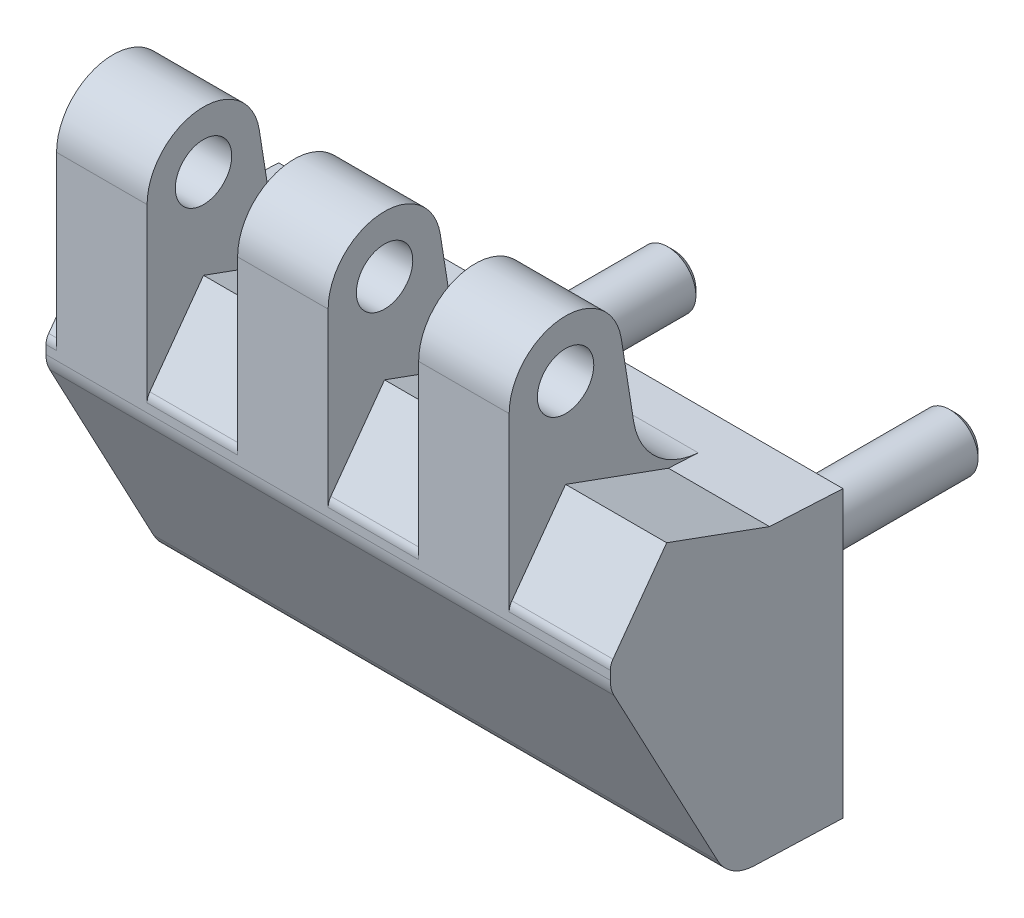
ISO-10303-21;
HEADER;
FILE_DESCRIPTION(('STEP AP214'),'2;1');
FILE_NAME('part.step','',(''),(''),'','','');
FILE_SCHEMA(('AUTOMOTIVE_DESIGN { 1 0 10303 214 1 1 1 1 }'));
ENDSEC;
DATA;
#1=APPLICATION_CONTEXT('core data for automotive mechanical design processes');
#2=APPLICATION_PROTOCOL_DEFINITION('international standard','automotive_design',2000,#1);
#3=PRODUCT_CONTEXT('',#1,'mechanical');
#4=PRODUCT('Part','Part','',(#3));
#5=PRODUCT_RELATED_PRODUCT_CATEGORY('part','',(#4));
#6=PRODUCT_DEFINITION_FORMATION('','',#4);
#7=PRODUCT_DEFINITION_CONTEXT('part definition',#1,'design');
#8=PRODUCT_DEFINITION('design','',#6,#7);
#9=PRODUCT_DEFINITION_SHAPE('','',#8);
#10=(LENGTH_UNIT() NAMED_UNIT(*) SI_UNIT(.MILLI.,.METRE.));
#11=(NAMED_UNIT(*) PLANE_ANGLE_UNIT() SI_UNIT($,.RADIAN.));
#12=(NAMED_UNIT(*) SI_UNIT($,.STERADIAN.) SOLID_ANGLE_UNIT());
#13=UNCERTAINTY_MEASURE_WITH_UNIT(LENGTH_MEASURE(1.E-05),#10,'distance_accuracy_value','');
#14=(GEOMETRIC_REPRESENTATION_CONTEXT(3) GLOBAL_UNCERTAINTY_ASSIGNED_CONTEXT((#13)) GLOBAL_UNIT_ASSIGNED_CONTEXT((#10,
#11,#12)) REPRESENTATION_CONTEXT('',''));
#15=CARTESIAN_POINT('',(0.,0.,0.));
#16=DIRECTION('',(0.,0.,1.));
#17=DIRECTION('',(1.,0.,0.));
#18=AXIS2_PLACEMENT_3D('',#15,#16,#17);
#19=CARTESIAN_POINT('',(30.25,10.93,0.));
#20=DIRECTION('',(0.,0.998629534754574,-0.0523359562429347));
#21=DIRECTION('',(0.,0.0523359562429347,0.998629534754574));
#22=AXIS2_PLACEMENT_3D('',#19,#20,#21);
#23=PLANE('',#22);
#24=DIRECTION('',(-1.,0.,0.));
#25=VECTOR('',#24,1.);
#26=CARTESIAN_POINT('',(30.25,10.93,0.));
#27=LINE('',#26,#25);
#28=CARTESIAN_POINT('',(30.,10.93,0.));
#29=VERTEX_POINT('',#28);
#30=CARTESIAN_POINT('',(-10.,10.93,0.));
#31=VERTEX_POINT('',#30);
#32=EDGE_CURVE('E258',#29,#31,#27,.T.);
#33=ORIENTED_EDGE('',*,*,#32,.T.);
#34=DIRECTION('',(0.,-0.0523359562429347,-0.998629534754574));
#35=VECTOR('',#34,1.);
#36=CARTESIAN_POINT('',(-10.,11.2029078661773,5.2073922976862));
#37=LINE('',#36,#35);
#38=CARTESIAN_POINT('',(-10.,11.2029078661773,5.2073922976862));
#39=VERTEX_POINT('',#38);
#40=EDGE_CURVE('E239',#39,#31,#37,.T.);
#41=ORIENTED_EDGE('',*,*,#40,.F.);
#42=DIRECTION('',(-1.,0.,0.));
#43=VECTOR('',#42,1.);
#44=CARTESIAN_POINT('',(30.25,11.2029078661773,5.2073922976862));
#45=LINE('',#44,#43);
#46=CARTESIAN_POINT('',(-9.2499999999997,11.2029078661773,5.2073922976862));
#47=VERTEX_POINT('',#46);
#48=EDGE_CURVE('E1264',#47,#39,#45,.T.);
#49=ORIENTED_EDGE('',*,*,#48,.F.);
#50=DIRECTION('',(0.,0.0523359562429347,0.998629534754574));
#51=VECTOR('',#50,1.);
#52=CARTESIAN_POINT('',(-9.2499999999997,10.93,0.));
#53=LINE('',#52,#51);
#54=CARTESIAN_POINT('',(-9.2499999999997,11.0922838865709,3.09656102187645));
#55=VERTEX_POINT('',#54);
#56=EDGE_CURVE('E1146',#55,#47,#53,.T.);
#57=ORIENTED_EDGE('',*,*,#56,.F.);
#58=DIRECTION('',(1.,0.,0.));
#59=VECTOR('',#58,1.);
#60=CARTESIAN_POINT('',(-9.2499999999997,11.0922838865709,3.09656102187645));
#61=LINE('',#60,#59);
#62=CARTESIAN_POINT('',(-2.833333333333,11.0922838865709,3.09656102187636));
#63=VERTEX_POINT('',#62);
#64=EDGE_CURVE('E269',#63,#55,#61,.F.);
#65=ORIENTED_EDGE('',*,*,#64,.F.);
#66=DIRECTION('',(0.,0.0523359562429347,0.998629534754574));
#67=VECTOR('',#66,1.);
#68=CARTESIAN_POINT('',(-2.833333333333,10.93,0.));
#69=LINE('',#68,#67);
#70=CARTESIAN_POINT('',(-2.833333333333,11.2029078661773,5.2073922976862));
#71=VERTEX_POINT('',#70);
#72=EDGE_CURVE('E1284',#63,#71,#69,.T.);
#73=ORIENTED_EDGE('',*,*,#72,.T.);
#74=CARTESIAN_POINT('',(3.5833333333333,11.2029078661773,5.2073922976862));
#75=VERTEX_POINT('',#74);
#76=EDGE_CURVE('E1268',#75,#71,#45,.T.);
#77=ORIENTED_EDGE('',*,*,#76,.F.);
#78=DIRECTION('',(0.,0.0523359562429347,0.998629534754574));
#79=VECTOR('',#78,1.);
#80=CARTESIAN_POINT('',(3.5833333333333,10.93,0.));
#81=LINE('',#80,#79);
#82=CARTESIAN_POINT('',(3.5833333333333,11.0922838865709,3.09656102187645));
#83=VERTEX_POINT('',#82);
#84=EDGE_CURVE('E1239',#83,#75,#81,.T.);
#85=ORIENTED_EDGE('',*,*,#84,.F.);
#86=DIRECTION('',(1.,0.,0.));
#87=VECTOR('',#86,1.);
#88=CARTESIAN_POINT('',(3.5833333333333,11.0922838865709,3.09656102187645));
#89=LINE('',#88,#87);
#90=CARTESIAN_POINT('',(10.,11.0922838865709,3.09656102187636));
#91=VERTEX_POINT('',#90);
#92=EDGE_CURVE('E257',#91,#83,#89,.F.);
#93=ORIENTED_EDGE('',*,*,#92,.F.);
#94=DIRECTION('',(0.,0.0523359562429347,0.998629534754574));
#95=VECTOR('',#94,1.);
#96=CARTESIAN_POINT('',(10.,10.93,0.));
#97=LINE('',#96,#95);
#98=CARTESIAN_POINT('',(10.,11.2029078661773,5.2073922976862));
#99=VERTEX_POINT('',#98);
#100=EDGE_CURVE('E1227',#91,#99,#97,.T.);
#101=ORIENTED_EDGE('',*,*,#100,.T.);
#102=CARTESIAN_POINT('',(16.4166666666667,11.2029078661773,5.2073922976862));
#103=VERTEX_POINT('',#102);
#104=EDGE_CURVE('E1267',#103,#99,#45,.T.);
#105=ORIENTED_EDGE('',*,*,#104,.F.);
#106=DIRECTION('',(0.,0.0523359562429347,0.998629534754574));
#107=VECTOR('',#106,1.);
#108=CARTESIAN_POINT('',(16.4166666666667,10.93,0.));
#109=LINE('',#108,#107);
#110=CARTESIAN_POINT('',(16.4166666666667,11.0922838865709,3.09656102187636));
#111=VERTEX_POINT('',#110);
#112=EDGE_CURVE('E1333',#111,#103,#109,.T.);
#113=ORIENTED_EDGE('',*,*,#112,.F.);
#114=DIRECTION('',(-1.,0.,0.));
#115=VECTOR('',#114,1.);
#116=CARTESIAN_POINT('',(22.8333333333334,11.0922838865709,3.09656102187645));
#117=LINE('',#116,#115);
#118=CARTESIAN_POINT('',(22.8333333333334,11.0922838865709,3.09656102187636));
#119=VERTEX_POINT('',#118);
#120=EDGE_CURVE('E261',#111,#119,#117,.F.);
#121=ORIENTED_EDGE('',*,*,#120,.T.);
#122=DIRECTION('',(0.,0.0523359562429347,0.998629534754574));
#123=VECTOR('',#122,1.);
#124=CARTESIAN_POINT('',(22.8333333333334,10.93,0.));
#125=LINE('',#124,#123);
#126=CARTESIAN_POINT('',(22.8333333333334,11.2029078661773,5.2073922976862));
#127=VERTEX_POINT('',#126);
#128=EDGE_CURVE('E1189',#119,#127,#125,.T.);
#129=ORIENTED_EDGE('',*,*,#128,.T.);
#130=CARTESIAN_POINT('',(30.,11.2029078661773,5.2073922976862));
#131=VERTEX_POINT('',#130);
#132=EDGE_CURVE('E263',#131,#127,#45,.T.);
#133=ORIENTED_EDGE('',*,*,#132,.F.);
#134=DIRECTION('',(0.,0.0523359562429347,0.998629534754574));
#135=VECTOR('',#134,1.);
#136=CARTESIAN_POINT('',(30.,10.93,0.));
#137=LINE('',#136,#135);
#138=EDGE_CURVE('E1368',#29,#131,#137,.T.);
#139=ORIENTED_EDGE('',*,*,#138,.F.);
#140=EDGE_LOOP('',(#33,#41,#49,#57,#65,#73,#77,#85,#93,#101,#105,#113,#121,#129,#133,#139));
#141=FACE_BOUND('',#140,.T.);
#142=ADVANCED_FACE('F14',(#141),#23,.T.);
#143=CARTESIAN_POINT('',(30.25,-9.07892726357,6.330694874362));
#144=DIRECTION('',(0.,-0.999390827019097,0.0348994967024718));
#145=DIRECTION('',(0.,-0.0348994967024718,-0.999390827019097));
#146=AXIS2_PLACEMENT_3D('',#143,#144,#145);
#147=PLANE('',#146);
#148=DIRECTION('',(-1.,0.,0.));
#149=VECTOR('',#148,1.);
#150=CARTESIAN_POINT('',(30.25,-9.07892726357,6.330694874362));
#151=LINE('',#150,#149);
#152=CARTESIAN_POINT('',(30.,-9.07892726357,6.330694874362));
#153=VERTEX_POINT('',#152);
#154=CARTESIAN_POINT('',(-10.,-9.07892726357,6.330694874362));
#155=VERTEX_POINT('',#154);
#156=EDGE_CURVE('E251',#153,#155,#151,.T.);
#157=ORIENTED_EDGE('',*,*,#156,.T.);
#158=DIRECTION('',(0.,0.0348994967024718,0.999390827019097));
#159=VECTOR('',#158,1.);
#160=CARTESIAN_POINT('',(-10.,-9.3,0.));
#161=LINE('',#160,#159);
#162=CARTESIAN_POINT('',(-10.,-9.3,0.));
#163=VERTEX_POINT('',#162);
#164=EDGE_CURVE('E236',#163,#155,#161,.T.);
#165=ORIENTED_EDGE('',*,*,#164,.F.);
#166=DIRECTION('',(-1.,0.,0.));
#167=VECTOR('',#166,1.);
#168=CARTESIAN_POINT('',(30.25,-9.3,0.));
#169=LINE('',#168,#167);
#170=CARTESIAN_POINT('',(30.,-9.3,0.));
#171=VERTEX_POINT('',#170);
#172=EDGE_CURVE('E249',#171,#163,#169,.T.);
#173=ORIENTED_EDGE('',*,*,#172,.F.);
#174=DIRECTION('',(0.,-0.0348994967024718,-0.999390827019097));
#175=VECTOR('',#174,1.);
#176=CARTESIAN_POINT('',(30.,-9.07892726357,6.330694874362));
#177=LINE('',#176,#175);
#178=EDGE_CURVE('E1437',#153,#171,#177,.T.);
#179=ORIENTED_EDGE('',*,*,#178,.F.);
#180=EDGE_LOOP('',(#157,#165,#173,#179));
#181=FACE_BOUND('',#180,.T.);
#182=ADVANCED_FACE('F16',(#181),#147,.T.);
#183=CARTESIAN_POINT('',(30.25,-9.3,0.));
#184=DIRECTION('',(0.,0.,-1.));
#185=DIRECTION('',(1.,0.,0.));
#186=AXIS2_PLACEMENT_3D('',#183,#184,#185);
#187=PLANE('',#186);
#188=CARTESIAN_POINT('',(20.,0.,0.));
#189=DIRECTION('',(0.,0.,1.));
#190=DIRECTION('',(1.,0.,0.));
#191=AXIS2_PLACEMENT_3D('',#188,#189,#190);
#192=CIRCLE('',#191,2.);
#193=CARTESIAN_POINT('',(22.,0.,0.));
#194=VERTEX_POINT('',#193);
#195=EDGE_CURVE('E9',#194,#194,#192,.T.);
#196=ORIENTED_EDGE('',*,*,#195,.T.);
#197=EDGE_LOOP('',(#196));
#198=FACE_BOUND('',#197,.T.);
#199=CARTESIAN_POINT('',(0.,0.,0.));
#200=DIRECTION('',(0.,0.,1.));
#201=DIRECTION('',(1.,0.,0.));
#202=AXIS2_PLACEMENT_3D('',#199,#200,#201);
#203=CIRCLE('',#202,2.);
#204=CARTESIAN_POINT('',(2.,0.,0.));
#205=VERTEX_POINT('',#204);
#206=EDGE_CURVE('E22',#205,#205,#203,.T.);
#207=ORIENTED_EDGE('',*,*,#206,.T.);
#208=EDGE_LOOP('',(#207));
#209=FACE_BOUND('',#208,.T.);
#210=ORIENTED_EDGE('',*,*,#172,.T.);
#211=DIRECTION('',(0.,-1.,0.));
#212=VECTOR('',#211,1.);
#213=CARTESIAN_POINT('',(-10.,10.93,0.));
#214=LINE('',#213,#212);
#215=EDGE_CURVE('E233',#31,#163,#214,.T.);
#216=ORIENTED_EDGE('',*,*,#215,.F.);
#217=ORIENTED_EDGE('',*,*,#32,.F.);
#218=DIRECTION('',(0.,1.,0.));
#219=VECTOR('',#218,1.);
#220=CARTESIAN_POINT('',(30.,-9.3,0.));
#221=LINE('',#220,#219);
#222=EDGE_CURVE('E256',#171,#29,#221,.T.);
#223=ORIENTED_EDGE('',*,*,#222,.F.);
#224=EDGE_LOOP('',(#210,#216,#217,#223));
#225=FACE_BOUND('',#224,.T.);
#226=ADVANCED_FACE('F255',(#198,#209,#225),#187,.T.);
#227=CARTESIAN_POINT('',(30.25,8.026752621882,16.5));
#228=DIRECTION('',(0.,0.,1.));
#229=DIRECTION('',(-1.,0.,0.));
#230=AXIS2_PLACEMENT_3D('',#227,#228,#229);
#231=PLANE('',#230);
#232=DIRECTION('',(-1.,0.,0.));
#233=VECTOR('',#232,1.);
#234=CARTESIAN_POINT('',(30.25,8.026752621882,16.5));
#235=LINE('',#234,#233);
#236=CARTESIAN_POINT('',(-9.2499999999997,8.026752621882,16.5));
#237=VERTEX_POINT('',#236);
#238=CARTESIAN_POINT('',(-10.,8.026752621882,16.5));
#239=VERTEX_POINT('',#238);
#240=EDGE_CURVE('E1252',#237,#239,#235,.T.);
#241=ORIENTED_EDGE('',*,*,#240,.T.);
#242=DIRECTION('',(0.,1.,0.));
#243=VECTOR('',#242,1.);
#244=CARTESIAN_POINT('',(-10.,7.41266032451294,16.5));
#245=LINE('',#244,#243);
#246=CARTESIAN_POINT('',(-10.,7.41266032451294,16.5));
#247=VERTEX_POINT('',#246);
#248=EDGE_CURVE('E29',#247,#239,#245,.T.);
#249=ORIENTED_EDGE('',*,*,#248,.F.);
#250=DIRECTION('',(-1.,0.,0.));
#251=VECTOR('',#250,1.);
#252=CARTESIAN_POINT('',(30.25,7.412660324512,16.5));
#253=LINE('',#252,#251);
#254=CARTESIAN_POINT('',(30.,7.412660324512,16.5));
#255=VERTEX_POINT('',#254);
#256=EDGE_CURVE('E1249',#255,#247,#253,.T.);
#257=ORIENTED_EDGE('',*,*,#256,.F.);
#258=DIRECTION('',(0.,-1.,0.));
#259=VECTOR('',#258,1.);
#260=CARTESIAN_POINT('',(30.,8.026752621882,16.5));
#261=LINE('',#260,#259);
#262=CARTESIAN_POINT('',(30.,8.026752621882,16.5));
#263=VERTEX_POINT('',#262);
#264=EDGE_CURVE('E1366',#263,#255,#261,.T.);
#265=ORIENTED_EDGE('',*,*,#264,.F.);
#266=CARTESIAN_POINT('',(22.8333333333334,8.026752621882,16.5));
#267=VERTEX_POINT('',#266);
#268=EDGE_CURVE('E1253',#263,#267,#235,.T.);
#269=ORIENTED_EDGE('',*,*,#268,.T.);
#270=DIRECTION('',(0.,-1.,0.));
#271=VECTOR('',#270,1.);
#272=CARTESIAN_POINT('',(22.8333333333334,20.2,16.5));
#273=LINE('',#272,#271);
#274=CARTESIAN_POINT('',(22.8333333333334,20.2,16.5));
#275=VERTEX_POINT('',#274);
#276=EDGE_CURVE('E1165',#275,#267,#273,.T.);
#277=ORIENTED_EDGE('',*,*,#276,.F.);
#278=DIRECTION('',(-1.,0.,0.));
#279=VECTOR('',#278,1.);
#280=CARTESIAN_POINT('',(22.8333333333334,20.2,16.5));
#281=LINE('',#280,#279);
#282=CARTESIAN_POINT('',(16.4166666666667,20.2,16.5));
#283=VERTEX_POINT('',#282);
#284=EDGE_CURVE('E1315',#275,#283,#281,.T.);
#285=ORIENTED_EDGE('',*,*,#284,.T.);
#286=DIRECTION('',(0.,-1.,0.));
#287=VECTOR('',#286,1.);
#288=CARTESIAN_POINT('',(16.4166666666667,20.2,16.5));
#289=LINE('',#288,#287);
#290=CARTESIAN_POINT('',(16.4166666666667,8.026752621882,16.5));
#291=VERTEX_POINT('',#290);
#292=EDGE_CURVE('E1142',#283,#291,#289,.T.);
#293=ORIENTED_EDGE('',*,*,#292,.T.);
#294=CARTESIAN_POINT('',(10.,8.026752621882,16.5));
#295=VERTEX_POINT('',#294);
#296=EDGE_CURVE('E1256',#291,#295,#235,.T.);
#297=ORIENTED_EDGE('',*,*,#296,.T.);
#298=DIRECTION('',(0.,-1.,0.));
#299=VECTOR('',#298,1.);
#300=CARTESIAN_POINT('',(10.,20.2,16.5));
#301=LINE('',#300,#299);
#302=CARTESIAN_POINT('',(10.,20.2,16.5));
#303=VERTEX_POINT('',#302);
#304=EDGE_CURVE('E1186',#303,#295,#301,.T.);
#305=ORIENTED_EDGE('',*,*,#304,.F.);
#306=DIRECTION('',(1.,0.,0.));
#307=VECTOR('',#306,1.);
#308=CARTESIAN_POINT('',(3.5833333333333,20.2,16.5));
#309=LINE('',#308,#307);
#310=CARTESIAN_POINT('',(3.5833333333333,20.2,16.5));
#311=VERTEX_POINT('',#310);
#312=EDGE_CURVE('E1209',#311,#303,#309,.T.);
#313=ORIENTED_EDGE('',*,*,#312,.F.);
#314=DIRECTION('',(0.,-1.,0.));
#315=VECTOR('',#314,1.);
#316=CARTESIAN_POINT('',(3.5833333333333,20.2,16.5));
#317=LINE('',#316,#315);
#318=CARTESIAN_POINT('',(3.5833333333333,8.026752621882,16.5));
#319=VERTEX_POINT('',#318);
#320=EDGE_CURVE('E1171',#311,#319,#317,.T.);
#321=ORIENTED_EDGE('',*,*,#320,.T.);
#322=CARTESIAN_POINT('',(-2.833333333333,8.026752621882,16.5));
#323=VERTEX_POINT('',#322);
#324=EDGE_CURVE('E1257',#319,#323,#235,.T.);
#325=ORIENTED_EDGE('',*,*,#324,.T.);
#326=DIRECTION('',(0.,-1.,0.));
#327=VECTOR('',#326,1.);
#328=CARTESIAN_POINT('',(-2.833333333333,20.2,16.5));
#329=LINE('',#328,#327);
#330=CARTESIAN_POINT('',(-2.833333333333,20.2,16.5));
#331=VERTEX_POINT('',#330);
#332=EDGE_CURVE('E1136',#331,#323,#329,.T.);
#333=ORIENTED_EDGE('',*,*,#332,.F.);
#334=DIRECTION('',(1.,0.,0.));
#335=VECTOR('',#334,1.);
#336=CARTESIAN_POINT('',(-9.2499999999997,20.2,16.5));
#337=LINE('',#336,#335);
#338=CARTESIAN_POINT('',(-9.2499999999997,20.2,16.5));
#339=VERTEX_POINT('',#338);
#340=EDGE_CURVE('E1399',#339,#331,#337,.T.);
#341=ORIENTED_EDGE('',*,*,#340,.F.);
#342=DIRECTION('',(0.,-1.,0.));
#343=VECTOR('',#342,1.);
#344=CARTESIAN_POINT('',(-9.2499999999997,20.2,16.5));
#345=LINE('',#344,#343);
#346=EDGE_CURVE('E1121',#339,#237,#345,.T.);
#347=ORIENTED_EDGE('',*,*,#346,.T.);
#348=EDGE_LOOP('',(#241,#249,#257,#265,#269,#277,#285,#293,#297,#305,#313,#321,#325,#333,#341,#347));
#349=FACE_BOUND('',#348,.T.);
#350=ADVANCED_FACE('F305',(#349),#231,.T.);
#351=CARTESIAN_POINT('',(30.25,7.41266032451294,14.2499999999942));
#352=DIRECTION('',(-1.,0.,0.));
#353=DIRECTION('',(0.,1.,0.));
#354=AXIS2_PLACEMENT_3D('',#351,#352,#353);
#355=CYLINDRICAL_SURFACE('',#354,2.25000000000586);
#356=ORIENTED_EDGE('',*,*,#256,.T.);
#357=CARTESIAN_POINT('',(-10.,7.41266032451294,14.2499999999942));
#358=DIRECTION('',(-1.,0.,0.));
#359=DIRECTION('',(0.,0.,1.));
#360=AXIS2_PLACEMENT_3D('',#357,#358,#359);
#361=CIRCLE('',#360,2.25000000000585);
#362=CARTESIAN_POINT('',(-10.,6.356349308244,16.236632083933));
#363=VERTEX_POINT('',#362);
#364=EDGE_CURVE('E1448',#363,#247,#361,.T.);
#365=ORIENTED_EDGE('',*,*,#364,.F.);
#366=DIRECTION('',(-1.,0.,0.));
#367=VECTOR('',#366,1.);
#368=CARTESIAN_POINT('',(30.25,6.356349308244,16.236632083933));
#369=LINE('',#368,#367);
#370=CARTESIAN_POINT('',(30.,6.356349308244,16.236632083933));
#371=VERTEX_POINT('',#370);
#372=EDGE_CURVE('E1246',#371,#363,#369,.T.);
#373=ORIENTED_EDGE('',*,*,#372,.F.);
#374=CARTESIAN_POINT('',(30.,7.41266032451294,14.2499999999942));
#375=DIRECTION('',(1.,0.,0.));
#376=DIRECTION('',(0.,0.,-1.));
#377=AXIS2_PLACEMENT_3D('',#374,#375,#376);
#378=CIRCLE('',#377,2.25000000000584);
#379=EDGE_CURVE('E1373',#255,#371,#378,.T.);
#380=ORIENTED_EDGE('',*,*,#379,.F.);
#381=EDGE_LOOP('',(#356,#365,#373,#380));
#382=FACE_BOUND('',#381,.T.);
#383=ADVANCED_FACE('F311',(#382),#355,.T.);
#384=CARTESIAN_POINT('',(30.25,6.356349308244,16.236632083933));
#385=DIRECTION('',(0.,-0.469471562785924,0.882947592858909));
#386=DIRECTION('',(0.,-0.882947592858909,-0.469471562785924));
#387=AXIS2_PLACEMENT_3D('',#384,#385,#386);
#388=PLANE('',#387);
#389=ORIENTED_EDGE('',*,*,#372,.T.);
#390=DIRECTION('',(0.,0.882947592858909,0.469471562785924));
#391=VECTOR('',#390,1.);
#392=CARTESIAN_POINT('',(-10.,-7.48916947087,8.8748391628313));
#393=LINE('',#392,#391);
#394=CARTESIAN_POINT('',(-10.,-7.48916947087,8.87483916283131));
#395=VERTEX_POINT('',#394);
#396=EDGE_CURVE('E1454',#395,#363,#393,.T.);
#397=ORIENTED_EDGE('',*,*,#396,.F.);
#398=DIRECTION('',(-1.,0.,0.));
#399=VECTOR('',#398,1.);
#400=CARTESIAN_POINT('',(30.25,-7.48916947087,8.8748391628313));
#401=LINE('',#400,#399);
#402=CARTESIAN_POINT('',(30.,-7.48916947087,8.8748391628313));
#403=VERTEX_POINT('',#402);
#404=EDGE_CURVE('E1243',#403,#395,#401,.T.);
#405=ORIENTED_EDGE('',*,*,#404,.F.);
#406=DIRECTION('',(0.,-0.882947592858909,-0.469471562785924));
#407=VECTOR('',#406,1.);
#408=CARTESIAN_POINT('',(30.,6.356349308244,16.236632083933));
#409=LINE('',#408,#407);
#410=EDGE_CURVE('E37',#371,#403,#409,.T.);
#411=ORIENTED_EDGE('',*,*,#410,.F.);
#412=EDGE_LOOP('',(#389,#397,#405,#411));
#413=FACE_BOUND('',#412,.T.);
#414=ADVANCED_FACE('F711',(#413),#388,.T.);
#415=CARTESIAN_POINT('',(30.25,-6.08075478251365,6.2259963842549));
#416=DIRECTION('',(-1.,0.,0.));
#417=DIRECTION('',(0.,1.,0.));
#418=AXIS2_PLACEMENT_3D('',#415,#416,#417);
#419=CYLINDRICAL_SURFACE('',#418,2.99999999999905);
#420=ORIENTED_EDGE('',*,*,#404,.T.);
#421=CARTESIAN_POINT('',(-10.,-6.08075478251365,6.2259963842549));
#422=DIRECTION('',(-1.,0.,0.));
#423=DIRECTION('',(0.,0.,1.));
#424=AXIS2_PLACEMENT_3D('',#421,#422,#423);
#425=CIRCLE('',#424,2.99999999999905);
#426=EDGE_CURVE('E252',#155,#395,#425,.T.);
#427=ORIENTED_EDGE('',*,*,#426,.F.);
#428=ORIENTED_EDGE('',*,*,#156,.F.);
#429=CARTESIAN_POINT('',(30.,-6.08075478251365,6.2259963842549));
#430=DIRECTION('',(1.,0.,0.));
#431=DIRECTION('',(0.,0.,-1.));
#432=AXIS2_PLACEMENT_3D('',#429,#430,#431);
#433=CIRCLE('',#432,2.99999999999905);
#434=EDGE_CURVE('E1435',#403,#153,#433,.T.);
#435=ORIENTED_EDGE('',*,*,#434,.F.);
#436=EDGE_LOOP('',(#420,#427,#428,#435));
#437=FACE_BOUND('',#436,.T.);
#438=ADVANCED_FACE('F701',(#437),#419,.T.);
#439=CARTESIAN_POINT('',(30.25,11.2029078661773,5.2073922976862));
#440=DIRECTION('',(0.,0.939692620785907,-0.342020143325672));
#441=DIRECTION('',(0.,0.342020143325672,0.939692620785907));
#442=AXIS2_PLACEMENT_3D('',#439,#440,#441);
#443=PLANE('',#442);
#444=ORIENTED_EDGE('',*,*,#48,.T.);
#445=DIRECTION('',(0.,-0.342020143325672,-0.939692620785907));
#446=VECTOR('',#445,1.);
#447=CARTESIAN_POINT('',(-10.,13.8572,12.5));
#448=LINE('',#447,#446);
#449=CARTESIAN_POINT('',(-10.,13.8572,12.5));
#450=VERTEX_POINT('',#449);
#451=EDGE_CURVE('E1428',#450,#39,#448,.T.);
#452=ORIENTED_EDGE('',*,*,#451,.F.);
#453=DIRECTION('',(-1.,0.,0.));
#454=VECTOR('',#453,1.);
#455=CARTESIAN_POINT('',(30.25,13.8572,12.5));
#456=LINE('',#455,#454);
#457=CARTESIAN_POINT('',(-9.2499999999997,13.8572,12.5));
#458=VERTEX_POINT('',#457);
#459=EDGE_CURVE('E1260',#458,#450,#456,.T.);
#460=ORIENTED_EDGE('',*,*,#459,.F.);
#461=DIRECTION('',(0.,0.342020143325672,0.939692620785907));
#462=VECTOR('',#461,1.);
#463=CARTESIAN_POINT('',(-9.2499999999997,11.2029078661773,5.2073922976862));
#464=LINE('',#463,#462);
#465=EDGE_CURVE('E1297',#47,#458,#464,.T.);
#466=ORIENTED_EDGE('',*,*,#465,.F.);
#467=EDGE_LOOP('',(#444,#452,#460,#466));
#468=FACE_BOUND('',#467,.T.);
#469=ADVANCED_FACE('F647',(#468),#443,.T.);
#470=CARTESIAN_POINT('',(30.25,13.8572,12.5));
#471=DIRECTION('',(0.,0.587785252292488,0.809016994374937));
#472=DIRECTION('',(0.,-0.809016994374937,0.587785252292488));
#473=AXIS2_PLACEMENT_3D('',#470,#471,#472);
#474=PLANE('',#473);
#475=ORIENTED_EDGE('',*,*,#459,.T.);
#476=DIRECTION('',(0.,0.809016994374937,-0.587785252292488));
#477=VECTOR('',#476,1.);
#478=CARTESIAN_POINT('',(-10.,8.614537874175,16.309016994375));
#479=LINE('',#478,#477);
#480=CARTESIAN_POINT('',(-10.,8.614537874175,16.309016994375));
#481=VERTEX_POINT('',#480);
#482=EDGE_CURVE('E1425',#481,#450,#479,.T.);
#483=ORIENTED_EDGE('',*,*,#482,.F.);
#484=DIRECTION('',(-1.,0.,0.));
#485=VECTOR('',#484,1.);
#486=CARTESIAN_POINT('',(30.25,8.614537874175,16.309016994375));
#487=LINE('',#486,#485);
#488=CARTESIAN_POINT('',(-9.2499999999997,8.614537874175,16.309016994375));
#489=VERTEX_POINT('',#488);
#490=EDGE_CURVE('E1255',#489,#481,#487,.T.);
#491=ORIENTED_EDGE('',*,*,#490,.F.);
#492=DIRECTION('',(0.,-0.809016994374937,0.587785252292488));
#493=VECTOR('',#492,1.);
#494=CARTESIAN_POINT('',(-9.2499999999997,13.8572,12.5));
#495=LINE('',#494,#493);
#496=EDGE_CURVE('E1289',#458,#489,#495,.T.);
#497=ORIENTED_EDGE('',*,*,#496,.F.);
#498=EDGE_LOOP('',(#475,#483,#491,#497));
#499=FACE_BOUND('',#498,.T.);
#500=ADVANCED_FACE('F637',(#499),#474,.T.);
#501=CARTESIAN_POINT('',(30.25,8.02675262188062,15.4999999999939));
#502=DIRECTION('',(-1.,0.,0.));
#503=DIRECTION('',(0.,1.,0.));
#504=AXIS2_PLACEMENT_3D('',#501,#502,#503);
#505=CYLINDRICAL_SURFACE('',#504,1.00000000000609);
#506=ORIENTED_EDGE('',*,*,#490,.T.);
#507=CARTESIAN_POINT('',(-10.,8.02675262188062,15.4999999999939));
#508=DIRECTION('',(-1.,0.,0.));
#509=DIRECTION('',(0.,0.,1.));
#510=AXIS2_PLACEMENT_3D('',#507,#508,#509);
#511=CIRCLE('',#510,1.0000000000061);
#512=EDGE_CURVE('E1422',#239,#481,#511,.T.);
#513=ORIENTED_EDGE('',*,*,#512,.F.);
#514=ORIENTED_EDGE('',*,*,#240,.F.);
#515=CARTESIAN_POINT('',(-9.2499999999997,8.02675262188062,15.4999999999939));
#516=DIRECTION('',(-1.,0.,0.));
#517=DIRECTION('',(0.,-1.,0.));
#518=AXIS2_PLACEMENT_3D('',#515,#516,#517);
#519=CIRCLE('',#518,1.00000000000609);
#520=EDGE_CURVE('E1286',#489,#237,#519,.F.);
#521=ORIENTED_EDGE('',*,*,#520,.F.);
#522=EDGE_LOOP('',(#506,#513,#514,#521));
#523=FACE_BOUND('',#522,.T.);
#524=ADVANCED_FACE('F627',(#523),#505,.T.);
#525=CARTESIAN_POINT('',(30.,13.8572,12.5));
#526=VERTEX_POINT('',#525);
#527=CARTESIAN_POINT('',(22.8333333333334,13.8572,12.5));
#528=VERTEX_POINT('',#527);
#529=EDGE_CURVE('E1263',#526,#528,#456,.T.);
#530=ORIENTED_EDGE('',*,*,#529,.F.);
#531=DIRECTION('',(0.,0.342020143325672,0.939692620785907));
#532=VECTOR('',#531,1.);
#533=CARTESIAN_POINT('',(30.,11.2029078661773,5.2073922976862));
#534=LINE('',#533,#532);
#535=EDGE_CURVE('E1364',#131,#526,#534,.T.);
#536=ORIENTED_EDGE('',*,*,#535,.F.);
#537=ORIENTED_EDGE('',*,*,#132,.T.);
#538=DIRECTION('',(0.,0.342020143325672,0.939692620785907));
#539=VECTOR('',#538,1.);
#540=CARTESIAN_POINT('',(22.8333333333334,11.2029078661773,5.2073922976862));
#541=LINE('',#540,#539);
#542=EDGE_CURVE('E1194',#127,#528,#541,.T.);
#543=ORIENTED_EDGE('',*,*,#542,.T.);
#544=EDGE_LOOP('',(#530,#536,#537,#543));
#545=FACE_BOUND('',#544,.T.);
#546=ADVANCED_FACE('F302',(#545),#443,.T.);
#547=CARTESIAN_POINT('',(30.,8.614537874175,16.309016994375));
#548=VERTEX_POINT('',#547);
#549=CARTESIAN_POINT('',(22.8333333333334,8.614537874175,16.309016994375));
#550=VERTEX_POINT('',#549);
#551=EDGE_CURVE('E1258',#548,#550,#487,.T.);
#552=ORIENTED_EDGE('',*,*,#551,.F.);
#553=DIRECTION('',(0.,-0.809016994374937,0.587785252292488));
#554=VECTOR('',#553,1.);
#555=CARTESIAN_POINT('',(30.,13.8572,12.5));
#556=LINE('',#555,#554);
#557=EDGE_CURVE('E1363',#526,#548,#556,.T.);
#558=ORIENTED_EDGE('',*,*,#557,.F.);
#559=ORIENTED_EDGE('',*,*,#529,.T.);
#560=DIRECTION('',(0.,-0.809016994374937,0.587785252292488));
#561=VECTOR('',#560,1.);
#562=CARTESIAN_POINT('',(22.8333333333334,13.8572,12.5));
#563=LINE('',#562,#561);
#564=EDGE_CURVE('E1339',#528,#550,#563,.T.);
#565=ORIENTED_EDGE('',*,*,#564,.T.);
#566=EDGE_LOOP('',(#552,#558,#559,#565));
#567=FACE_BOUND('',#566,.T.);
#568=ADVANCED_FACE('F606',(#567),#474,.T.);
#569=ORIENTED_EDGE('',*,*,#268,.F.);
#570=CARTESIAN_POINT('',(30.,8.02675262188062,15.4999999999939));
#571=DIRECTION('',(1.,0.,0.));
#572=DIRECTION('',(0.,0.,-1.));
#573=AXIS2_PLACEMENT_3D('',#570,#571,#572);
#574=CIRCLE('',#573,1.0000000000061);
#575=EDGE_CURVE('E1361',#548,#263,#574,.T.);
#576=ORIENTED_EDGE('',*,*,#575,.F.);
#577=ORIENTED_EDGE('',*,*,#551,.T.);
#578=CARTESIAN_POINT('',(22.8333333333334,8.02675262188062,15.4999999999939));
#579=DIRECTION('',(-1.,0.,0.));
#580=DIRECTION('',(0.,-1.,0.));
#581=AXIS2_PLACEMENT_3D('',#578,#579,#580);
#582=CIRCLE('',#581,1.00000000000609);
#583=EDGE_CURVE('E1336',#550,#267,#582,.F.);
#584=ORIENTED_EDGE('',*,*,#583,.T.);
#585=EDGE_LOOP('',(#569,#576,#577,#584));
#586=FACE_BOUND('',#585,.T.);
#587=ADVANCED_FACE('F594',(#586),#505,.T.);
#588=ORIENTED_EDGE('',*,*,#104,.T.);
#589=DIRECTION('',(0.,0.342020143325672,0.939692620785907));
#590=VECTOR('',#589,1.);
#591=CARTESIAN_POINT('',(10.,11.2029078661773,5.2073922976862));
#592=LINE('',#591,#590);
#593=CARTESIAN_POINT('',(10.,13.8572,12.5));
#594=VERTEX_POINT('',#593);
#595=EDGE_CURVE('E1224',#99,#594,#592,.T.);
#596=ORIENTED_EDGE('',*,*,#595,.T.);
#597=CARTESIAN_POINT('',(16.4166666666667,13.8572,12.5));
#598=VERTEX_POINT('',#597);
#599=EDGE_CURVE('E1265',#598,#594,#456,.T.);
#600=ORIENTED_EDGE('',*,*,#599,.F.);
#601=DIRECTION('',(0.,0.342020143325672,0.939692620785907));
#602=VECTOR('',#601,1.);
#603=CARTESIAN_POINT('',(16.4166666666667,11.2029078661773,5.2073922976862));
#604=LINE('',#603,#602);
#605=EDGE_CURVE('E1330',#103,#598,#604,.T.);
#606=ORIENTED_EDGE('',*,*,#605,.F.);
#607=EDGE_LOOP('',(#588,#596,#600,#606));
#608=FACE_BOUND('',#607,.T.);
#609=ADVANCED_FACE('F617',(#608),#443,.T.);
#610=ORIENTED_EDGE('',*,*,#599,.T.);
#611=DIRECTION('',(0.,-0.809016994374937,0.587785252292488));
#612=VECTOR('',#611,1.);
#613=CARTESIAN_POINT('',(10.,13.8572,12.5));
#614=LINE('',#613,#612);
#615=CARTESIAN_POINT('',(10.,8.614537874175,16.309016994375));
#616=VERTEX_POINT('',#615);
#617=EDGE_CURVE('E1221',#594,#616,#614,.T.);
#618=ORIENTED_EDGE('',*,*,#617,.T.);
#619=CARTESIAN_POINT('',(16.4166666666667,8.614537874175,16.309016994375));
#620=VERTEX_POINT('',#619);
#621=EDGE_CURVE('E1261',#620,#616,#487,.T.);
#622=ORIENTED_EDGE('',*,*,#621,.F.);
#623=DIRECTION('',(0.,-0.809016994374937,0.587785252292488));
#624=VECTOR('',#623,1.);
#625=CARTESIAN_POINT('',(16.4166666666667,13.8572,12.5));
#626=LINE('',#625,#624);
#627=EDGE_CURVE('E1327',#598,#620,#626,.T.);
#628=ORIENTED_EDGE('',*,*,#627,.F.);
#629=EDGE_LOOP('',(#610,#618,#622,#628));
#630=FACE_BOUND('',#629,.T.);
#631=ADVANCED_FACE('F607',(#630),#474,.T.);
#632=ORIENTED_EDGE('',*,*,#621,.T.);
#633=CARTESIAN_POINT('',(10.,8.02675262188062,15.4999999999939));
#634=DIRECTION('',(-1.,0.,0.));
#635=DIRECTION('',(0.,-1.,0.));
#636=AXIS2_PLACEMENT_3D('',#633,#634,#635);
#637=CIRCLE('',#636,1.00000000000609);
#638=EDGE_CURVE('E1218',#616,#295,#637,.F.);
#639=ORIENTED_EDGE('',*,*,#638,.T.);
#640=ORIENTED_EDGE('',*,*,#296,.F.);
#641=CARTESIAN_POINT('',(16.4166666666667,8.02675262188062,15.4999999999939));
#642=DIRECTION('',(-1.,0.,0.));
#643=DIRECTION('',(0.,-1.,0.));
#644=AXIS2_PLACEMENT_3D('',#641,#642,#643);
#645=CIRCLE('',#644,1.00000000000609);
#646=EDGE_CURVE('E1324',#620,#291,#645,.F.);
#647=ORIENTED_EDGE('',*,*,#646,.F.);
#648=EDGE_LOOP('',(#632,#639,#640,#647));
#649=FACE_BOUND('',#648,.T.);
#650=ADVANCED_FACE('F595',(#649),#505,.T.);
#651=DIRECTION('',(0.,0.342020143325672,0.939692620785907));
#652=VECTOR('',#651,1.);
#653=CARTESIAN_POINT('',(-2.833333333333,11.2029078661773,5.2073922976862));
#654=LINE('',#653,#652);
#655=CARTESIAN_POINT('',(-2.833333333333,13.8572,12.5));
#656=VERTEX_POINT('',#655);
#657=EDGE_CURVE('E1280',#71,#656,#654,.T.);
#658=ORIENTED_EDGE('',*,*,#657,.T.);
#659=CARTESIAN_POINT('',(3.5833333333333,13.8572,12.5));
#660=VERTEX_POINT('',#659);
#661=EDGE_CURVE('E1266',#660,#656,#456,.T.);
#662=ORIENTED_EDGE('',*,*,#661,.F.);
#663=DIRECTION('',(0.,0.342020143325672,0.939692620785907));
#664=VECTOR('',#663,1.);
#665=CARTESIAN_POINT('',(3.5833333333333,11.2029078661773,5.2073922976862));
#666=LINE('',#665,#664);
#667=EDGE_CURVE('E1236',#75,#660,#666,.T.);
#668=ORIENTED_EDGE('',*,*,#667,.F.);
#669=ORIENTED_EDGE('',*,*,#76,.T.);
#670=EDGE_LOOP('',(#658,#662,#668,#669));
#671=FACE_BOUND('',#670,.T.);
#672=ADVANCED_FACE('F604',(#671),#443,.T.);
#673=DIRECTION('',(0.,-0.809016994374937,0.587785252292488));
#674=VECTOR('',#673,1.);
#675=CARTESIAN_POINT('',(-2.833333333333,13.8572,12.5));
#676=LINE('',#675,#674);
#677=CARTESIAN_POINT('',(-2.833333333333,8.614537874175,16.309016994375));
#678=VERTEX_POINT('',#677);
#679=EDGE_CURVE('E1291',#656,#678,#676,.T.);
#680=ORIENTED_EDGE('',*,*,#679,.T.);
#681=CARTESIAN_POINT('',(3.5833333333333,8.614537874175,16.309016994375));
#682=VERTEX_POINT('',#681);
#683=EDGE_CURVE('E1262',#682,#678,#487,.T.);
#684=ORIENTED_EDGE('',*,*,#683,.F.);
#685=DIRECTION('',(0.,-0.809016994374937,0.587785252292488));
#686=VECTOR('',#685,1.);
#687=CARTESIAN_POINT('',(3.5833333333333,13.8572,12.5));
#688=LINE('',#687,#686);
#689=EDGE_CURVE('E1233',#660,#682,#688,.T.);
#690=ORIENTED_EDGE('',*,*,#689,.F.);
#691=ORIENTED_EDGE('',*,*,#661,.T.);
#692=EDGE_LOOP('',(#680,#684,#690,#691));
#693=FACE_BOUND('',#692,.T.);
#694=ADVANCED_FACE('F591',(#693),#474,.T.);
#695=CARTESIAN_POINT('',(-2.833333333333,8.02675262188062,15.4999999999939));
#696=DIRECTION('',(-1.,0.,0.));
#697=DIRECTION('',(0.,-1.,0.));
#698=AXIS2_PLACEMENT_3D('',#695,#696,#697);
#699=CIRCLE('',#698,1.00000000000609);
#700=EDGE_CURVE('E1408',#678,#323,#699,.F.);
#701=ORIENTED_EDGE('',*,*,#700,.T.);
#702=ORIENTED_EDGE('',*,*,#324,.F.);
#703=CARTESIAN_POINT('',(3.5833333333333,8.02675262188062,15.4999999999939));
#704=DIRECTION('',(-1.,0.,0.));
#705=DIRECTION('',(0.,-1.,0.));
#706=AXIS2_PLACEMENT_3D('',#703,#704,#705);
#707=CIRCLE('',#706,1.00000000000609);
#708=EDGE_CURVE('E1230',#682,#319,#707,.F.);
#709=ORIENTED_EDGE('',*,*,#708,.F.);
#710=ORIENTED_EDGE('',*,*,#683,.T.);
#711=EDGE_LOOP('',(#701,#702,#709,#710));
#712=FACE_BOUND('',#711,.T.);
#713=ADVANCED_FACE('F580',(#712),#505,.T.);
#714=CARTESIAN_POINT('',(3.5833333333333,16.0792045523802,2.73514398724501));
#715=DIRECTION('',(1.,0.,0.));
#716=DIRECTION('',(0.,-1.,0.));
#717=AXIS2_PLACEMENT_3D('',#714,#715,#716);
#718=CYLINDRICAL_SURFACE('',#717,4.99999999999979);
#719=ORIENTED_EDGE('',*,*,#92,.T.);
#720=CARTESIAN_POINT('',(3.5833333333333,16.0792045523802,2.73514398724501));
#721=DIRECTION('',(-1.,0.,0.));
#722=DIRECTION('',(0.,1.,0.));
#723=AXIS2_PLACEMENT_3D('',#720,#721,#722);
#724=CIRCLE('',#723,4.99999999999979);
#725=CARTESIAN_POINT('',(3.5833333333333,15.2970322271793,7.6735856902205));
#726=VERTEX_POINT('',#725);
#727=EDGE_CURVE('E1197',#83,#726,#724,.T.);
#728=ORIENTED_EDGE('',*,*,#727,.T.);
#729=DIRECTION('',(1.,0.,0.));
#730=VECTOR('',#729,1.);
#731=CARTESIAN_POINT('',(3.5833333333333,15.2970322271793,7.6735856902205));
#732=LINE('',#731,#730);
#733=CARTESIAN_POINT('',(10.,15.2970322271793,7.6735856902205));
#734=VERTEX_POINT('',#733);
#735=EDGE_CURVE('E1215',#726,#734,#732,.T.);
#736=ORIENTED_EDGE('',*,*,#735,.T.);
#737=CARTESIAN_POINT('',(10.,16.0792045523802,2.73514398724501));
#738=DIRECTION('',(-1.,0.,0.));
#739=DIRECTION('',(0.,1.,0.));
#740=AXIS2_PLACEMENT_3D('',#737,#738,#739);
#741=CIRCLE('',#740,4.99999999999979);
#742=EDGE_CURVE('E1181',#91,#734,#741,.T.);
#743=ORIENTED_EDGE('',*,*,#742,.F.);
#744=EDGE_LOOP('',(#719,#728,#736,#743));
#745=FACE_BOUND('',#744,.T.);
#746=ADVANCED_FACE('F569',(#745),#718,.F.);
#747=CARTESIAN_POINT('',(3.5833333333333,15.2970322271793,7.6735856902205));
#748=DIRECTION('',(0.,-0.15643446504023,0.987688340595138));
#749=DIRECTION('',(0.,-0.987688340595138,-0.15643446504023));
#750=AXIS2_PLACEMENT_3D('',#747,#748,#749);
#751=PLANE('',#750);
#752=DIRECTION('',(0.,0.987688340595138,0.15643446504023));
#753=VECTOR('',#752,1.);
#754=CARTESIAN_POINT('',(10.,15.2970322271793,7.6735856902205));
#755=LINE('',#754,#753);
#756=CARTESIAN_POINT('',(10.,20.8257378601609,8.5492466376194));
#757=VERTEX_POINT('',#756);
#758=EDGE_CURVE('E1176',#734,#757,#755,.T.);
#759=ORIENTED_EDGE('',*,*,#758,.F.);
#760=ORIENTED_EDGE('',*,*,#735,.F.);
#761=DIRECTION('',(0.,0.987688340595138,0.15643446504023));
#762=VECTOR('',#761,1.);
#763=CARTESIAN_POINT('',(3.5833333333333,15.2970322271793,7.6735856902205));
#764=LINE('',#763,#762);
#765=CARTESIAN_POINT('',(3.5833333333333,20.8257378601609,8.5492466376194));
#766=VERTEX_POINT('',#765);
#767=EDGE_CURVE('E1200',#726,#766,#764,.T.);
#768=ORIENTED_EDGE('',*,*,#767,.T.);
#769=DIRECTION('',(1.,0.,0.));
#770=VECTOR('',#769,1.);
#771=CARTESIAN_POINT('',(3.5833333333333,20.8257378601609,8.5492466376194));
#772=LINE('',#771,#770);
#773=EDGE_CURVE('E1212',#766,#757,#772,.T.);
#774=ORIENTED_EDGE('',*,*,#773,.T.);
#775=EDGE_LOOP('',(#759,#760,#768,#774));
#776=FACE_BOUND('',#775,.T.);
#777=ADVANCED_FACE('F558',(#776),#751,.F.);
#778=CARTESIAN_POINT('',(3.5833333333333,20.2,12.5));
#779=DIRECTION('',(1.,0.,0.));
#780=DIRECTION('',(0.,-1.,0.));
#781=AXIS2_PLACEMENT_3D('',#778,#779,#780);
#782=CYLINDRICAL_SURFACE('',#781,4.);
#783=CARTESIAN_POINT('',(10.,20.2,12.5));
#784=DIRECTION('',(1.,0.,0.));
#785=DIRECTION('',(0.,-1.,0.));
#786=AXIS2_PLACEMENT_3D('',#783,#784,#785);
#787=CIRCLE('',#786,4.);
#788=EDGE_CURVE('E1172',#757,#303,#787,.T.);
#789=ORIENTED_EDGE('',*,*,#788,.F.);
#790=ORIENTED_EDGE('',*,*,#773,.F.);
#791=CARTESIAN_POINT('',(3.5833333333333,20.2,12.5));
#792=DIRECTION('',(1.,0.,0.));
#793=DIRECTION('',(0.,-1.,0.));
#794=AXIS2_PLACEMENT_3D('',#791,#792,#793);
#795=CIRCLE('',#794,4.);
#796=EDGE_CURVE('E1203',#766,#311,#795,.T.);
#797=ORIENTED_EDGE('',*,*,#796,.T.);
#798=ORIENTED_EDGE('',*,*,#312,.T.);
#799=EDGE_LOOP('',(#789,#790,#797,#798));
#800=FACE_BOUND('',#799,.T.);
#801=ADVANCED_FACE('F547',(#800),#782,.T.);
#802=CARTESIAN_POINT('',(3.5833333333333,20.2,12.5));
#803=DIRECTION('',(1.,0.,0.));
#804=DIRECTION('',(0.,-1.,0.));
#805=AXIS2_PLACEMENT_3D('',#802,#803,#804);
#806=CYLINDRICAL_SURFACE('',#805,2.);
#807=CARTESIAN_POINT('',(3.5833333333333,20.2,12.5));
#808=DIRECTION('',(1.,0.,0.));
#809=DIRECTION('',(0.,1.,0.));
#810=AXIS2_PLACEMENT_3D('',#807,#808,#809);
#811=CIRCLE('',#810,2.);
#812=CARTESIAN_POINT('',(3.5833333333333,22.2,12.5));
#813=VERTEX_POINT('',#812);
#814=EDGE_CURVE('E1205',#813,#813,#811,.T.);
#815=ORIENTED_EDGE('',*,*,#814,.F.);
#816=EDGE_LOOP('',(#815));
#817=FACE_BOUND('',#816,.T.);
#818=CARTESIAN_POINT('',(10.,20.2,12.5));
#819=DIRECTION('',(1.,0.,0.));
#820=DIRECTION('',(0.,1.,0.));
#821=AXIS2_PLACEMENT_3D('',#818,#819,#820);
#822=CIRCLE('',#821,2.);
#823=CARTESIAN_POINT('',(10.,22.2,12.5));
#824=VERTEX_POINT('',#823);
#825=EDGE_CURVE('E1167',#824,#824,#822,.T.);
#826=ORIENTED_EDGE('',*,*,#825,.T.);
#827=EDGE_LOOP('',(#826));
#828=FACE_BOUND('',#827,.T.);
#829=ADVANCED_FACE('F536',(#817,#828),#806,.F.);
#830=CARTESIAN_POINT('',(3.5833333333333,16.0792045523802,2.73514398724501));
#831=DIRECTION('',(1.,0.,0.));
#832=DIRECTION('',(0.,-1.,0.));
#833=AXIS2_PLACEMENT_3D('',#830,#831,#832);
#834=PLANE('',#833);
#835=ORIENTED_EDGE('',*,*,#84,.T.);
#836=ORIENTED_EDGE('',*,*,#667,.T.);
#837=ORIENTED_EDGE('',*,*,#689,.T.);
#838=ORIENTED_EDGE('',*,*,#708,.T.);
#839=ORIENTED_EDGE('',*,*,#320,.F.);
#840=ORIENTED_EDGE('',*,*,#796,.F.);
#841=ORIENTED_EDGE('',*,*,#767,.F.);
#842=ORIENTED_EDGE('',*,*,#727,.F.);
#843=EDGE_LOOP('',(#835,#836,#837,#838,#839,#840,#841,#842));
#844=FACE_BOUND('',#843,.T.);
#845=ORIENTED_EDGE('',*,*,#814,.T.);
#846=EDGE_LOOP('',(#845));
#847=FACE_BOUND('',#846,.T.);
#848=ADVANCED_FACE('F525',(#844,#847),#834,.F.);
#849=CARTESIAN_POINT('',(10.,16.0792045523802,2.73514398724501));
#850=DIRECTION('',(1.,0.,0.));
#851=DIRECTION('',(0.,-1.,0.));
#852=AXIS2_PLACEMENT_3D('',#849,#850,#851);
#853=PLANE('',#852);
#854=ORIENTED_EDGE('',*,*,#742,.T.);
#855=ORIENTED_EDGE('',*,*,#758,.T.);
#856=ORIENTED_EDGE('',*,*,#788,.T.);
#857=ORIENTED_EDGE('',*,*,#304,.T.);
#858=ORIENTED_EDGE('',*,*,#638,.F.);
#859=ORIENTED_EDGE('',*,*,#617,.F.);
#860=ORIENTED_EDGE('',*,*,#595,.F.);
#861=ORIENTED_EDGE('',*,*,#100,.F.);
#862=EDGE_LOOP('',(#854,#855,#856,#857,#858,#859,#860,#861));
#863=FACE_BOUND('',#862,.T.);
#864=ORIENTED_EDGE('',*,*,#825,.F.);
#865=EDGE_LOOP('',(#864));
#866=FACE_BOUND('',#865,.T.);
#867=ADVANCED_FACE('F514',(#863,#866),#853,.T.);
#868=CARTESIAN_POINT('',(22.8333333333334,16.0792045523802,2.73514398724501));
#869=DIRECTION('',(-1.,0.,0.));
#870=DIRECTION('',(0.,1.,0.));
#871=AXIS2_PLACEMENT_3D('',#868,#869,#870);
#872=CYLINDRICAL_SURFACE('',#871,4.99999999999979);
#873=CARTESIAN_POINT('',(16.4166666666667,16.0792045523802,2.73514398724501));
#874=DIRECTION('',(-1.,0.,0.));
#875=DIRECTION('',(0.,1.,0.));
#876=AXIS2_PLACEMENT_3D('',#873,#874,#875);
#877=CIRCLE('',#876,4.99999999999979);
#878=CARTESIAN_POINT('',(16.4166666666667,15.2970322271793,7.6735856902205));
#879=VERTEX_POINT('',#878);
#880=EDGE_CURVE('E1145',#111,#879,#877,.T.);
#881=ORIENTED_EDGE('',*,*,#880,.T.);
#882=DIRECTION('',(-1.,0.,0.));
#883=VECTOR('',#882,1.);
#884=CARTESIAN_POINT('',(22.8333333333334,15.2970322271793,7.6735856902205));
#885=LINE('',#884,#883);
#886=CARTESIAN_POINT('',(22.8333333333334,15.2970322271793,7.6735856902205));
#887=VERTEX_POINT('',#886);
#888=EDGE_CURVE('E1321',#887,#879,#885,.T.);
#889=ORIENTED_EDGE('',*,*,#888,.F.);
#890=CARTESIAN_POINT('',(22.8333333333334,16.0792045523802,2.73514398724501));
#891=DIRECTION('',(-1.,0.,0.));
#892=DIRECTION('',(0.,1.,0.));
#893=AXIS2_PLACEMENT_3D('',#890,#891,#892);
#894=CIRCLE('',#893,4.99999999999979);
#895=EDGE_CURVE('E1302',#119,#887,#894,.T.);
#896=ORIENTED_EDGE('',*,*,#895,.F.);
#897=ORIENTED_EDGE('',*,*,#120,.F.);
#898=EDGE_LOOP('',(#881,#889,#896,#897));
#899=FACE_BOUND('',#898,.T.);
#900=ADVANCED_FACE('F503',(#899),#872,.F.);
#901=CARTESIAN_POINT('',(22.8333333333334,15.2970322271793,7.6735856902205));
#902=DIRECTION('',(0.,0.15643446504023,-0.987688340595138));
#903=DIRECTION('',(0.,0.987688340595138,0.15643446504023));
#904=AXIS2_PLACEMENT_3D('',#901,#902,#903);
#905=PLANE('',#904);
#906=DIRECTION('',(0.,0.987688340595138,0.15643446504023));
#907=VECTOR('',#906,1.);
#908=CARTESIAN_POINT('',(16.4166666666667,15.2970322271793,7.6735856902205));
#909=LINE('',#908,#907);
#910=CARTESIAN_POINT('',(16.4166666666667,20.8257378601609,8.5492466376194));
#911=VERTEX_POINT('',#910);
#912=EDGE_CURVE('E1152',#879,#911,#909,.T.);
#913=ORIENTED_EDGE('',*,*,#912,.T.);
#914=DIRECTION('',(-1.,0.,0.));
#915=VECTOR('',#914,1.);
#916=CARTESIAN_POINT('',(22.8333333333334,20.8257378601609,8.5492466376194));
#917=LINE('',#916,#915);
#918=CARTESIAN_POINT('',(22.8333333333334,20.8257378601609,8.5492466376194));
#919=VERTEX_POINT('',#918);
#920=EDGE_CURVE('E1318',#919,#911,#917,.T.);
#921=ORIENTED_EDGE('',*,*,#920,.F.);
#922=DIRECTION('',(0.,0.987688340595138,0.15643446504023));
#923=VECTOR('',#922,1.);
#924=CARTESIAN_POINT('',(22.8333333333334,15.2970322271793,7.6735856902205));
#925=LINE('',#924,#923);
#926=EDGE_CURVE('E1305',#887,#919,#925,.T.);
#927=ORIENTED_EDGE('',*,*,#926,.F.);
#928=ORIENTED_EDGE('',*,*,#888,.T.);
#929=EDGE_LOOP('',(#913,#921,#927,#928));
#930=FACE_BOUND('',#929,.T.);
#931=ADVANCED_FACE('F492',(#930),#905,.T.);
#932=CARTESIAN_POINT('',(22.8333333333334,20.2,12.5));
#933=DIRECTION('',(-1.,0.,0.));
#934=DIRECTION('',(0.,1.,0.));
#935=AXIS2_PLACEMENT_3D('',#932,#933,#934);
#936=CYLINDRICAL_SURFACE('',#935,4.);
#937=CARTESIAN_POINT('',(16.4166666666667,20.2,12.5));
#938=DIRECTION('',(1.,0.,0.));
#939=DIRECTION('',(0.,-1.,0.));
#940=AXIS2_PLACEMENT_3D('',#937,#938,#939);
#941=CIRCLE('',#940,4.);
#942=EDGE_CURVE('E1148',#911,#283,#941,.T.);
#943=ORIENTED_EDGE('',*,*,#942,.T.);
#944=ORIENTED_EDGE('',*,*,#284,.F.);
#945=CARTESIAN_POINT('',(22.8333333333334,20.2,12.5));
#946=DIRECTION('',(1.,0.,0.));
#947=DIRECTION('',(0.,-1.,0.));
#948=AXIS2_PLACEMENT_3D('',#945,#946,#947);
#949=CIRCLE('',#948,4.);
#950=EDGE_CURVE('E1308',#919,#275,#949,.T.);
#951=ORIENTED_EDGE('',*,*,#950,.F.);
#952=ORIENTED_EDGE('',*,*,#920,.T.);
#953=EDGE_LOOP('',(#943,#944,#951,#952));
#954=FACE_BOUND('',#953,.T.);
#955=ADVANCED_FACE('F481',(#954),#936,.T.);
#956=CARTESIAN_POINT('',(22.8333333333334,20.2,12.5));
#957=DIRECTION('',(-1.,0.,0.));
#958=DIRECTION('',(0.,1.,0.));
#959=AXIS2_PLACEMENT_3D('',#956,#957,#958);
#960=CYLINDRICAL_SURFACE('',#959,2.);
#961=CARTESIAN_POINT('',(22.8333333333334,20.2,12.5));
#962=DIRECTION('',(1.,0.,0.));
#963=DIRECTION('',(0.,1.,0.));
#964=AXIS2_PLACEMENT_3D('',#961,#962,#963);
#965=CIRCLE('',#964,2.);
#966=CARTESIAN_POINT('',(22.8333333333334,22.2,12.5));
#967=VERTEX_POINT('',#966);
#968=EDGE_CURVE('E1310',#967,#967,#965,.T.);
#969=ORIENTED_EDGE('',*,*,#968,.T.);
#970=EDGE_LOOP('',(#969));
#971=FACE_BOUND('',#970,.T.);
#972=CARTESIAN_POINT('',(16.4166666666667,20.2,12.5));
#973=DIRECTION('',(1.,0.,0.));
#974=DIRECTION('',(0.,1.,0.));
#975=AXIS2_PLACEMENT_3D('',#972,#973,#974);
#976=CIRCLE('',#975,2.);
#977=CARTESIAN_POINT('',(16.4166666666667,22.2,12.5));
#978=VERTEX_POINT('',#977);
#979=EDGE_CURVE('E1151',#978,#978,#976,.T.);
#980=ORIENTED_EDGE('',*,*,#979,.F.);
#981=EDGE_LOOP('',(#980));
#982=FACE_BOUND('',#981,.T.);
#983=ADVANCED_FACE('F470',(#971,#982),#960,.F.);
#984=CARTESIAN_POINT('',(22.8333333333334,16.0792045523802,2.73514398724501));
#985=DIRECTION('',(1.,0.,0.));
#986=DIRECTION('',(0.,-1.,0.));
#987=AXIS2_PLACEMENT_3D('',#984,#985,#986);
#988=PLANE('',#987);
#989=ORIENTED_EDGE('',*,*,#895,.T.);
#990=ORIENTED_EDGE('',*,*,#926,.T.);
#991=ORIENTED_EDGE('',*,*,#950,.T.);
#992=ORIENTED_EDGE('',*,*,#276,.T.);
#993=ORIENTED_EDGE('',*,*,#583,.F.);
#994=ORIENTED_EDGE('',*,*,#564,.F.);
#995=ORIENTED_EDGE('',*,*,#542,.F.);
#996=ORIENTED_EDGE('',*,*,#128,.F.);
#997=EDGE_LOOP('',(#989,#990,#991,#992,#993,#994,#995,#996));
#998=FACE_BOUND('',#997,.T.);
#999=ORIENTED_EDGE('',*,*,#968,.F.);
#1000=EDGE_LOOP('',(#999));
#1001=FACE_BOUND('',#1000,.T.);
#1002=ADVANCED_FACE('F459',(#998,#1001),#988,.T.);
#1003=CARTESIAN_POINT('',(16.4166666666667,16.0792045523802,2.73514398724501));
#1004=DIRECTION('',(1.,0.,0.));
#1005=DIRECTION('',(0.,-1.,0.));
#1006=AXIS2_PLACEMENT_3D('',#1003,#1004,#1005);
#1007=PLANE('',#1006);
#1008=ORIENTED_EDGE('',*,*,#112,.T.);
#1009=ORIENTED_EDGE('',*,*,#605,.T.);
#1010=ORIENTED_EDGE('',*,*,#627,.T.);
#1011=ORIENTED_EDGE('',*,*,#646,.T.);
#1012=ORIENTED_EDGE('',*,*,#292,.F.);
#1013=ORIENTED_EDGE('',*,*,#942,.F.);
#1014=ORIENTED_EDGE('',*,*,#912,.F.);
#1015=ORIENTED_EDGE('',*,*,#880,.F.);
#1016=EDGE_LOOP('',(#1008,#1009,#1010,#1011,#1012,#1013,#1014,#1015));
#1017=FACE_BOUND('',#1016,.T.);
#1018=ORIENTED_EDGE('',*,*,#979,.T.);
#1019=EDGE_LOOP('',(#1018));
#1020=FACE_BOUND('',#1019,.T.);
#1021=ADVANCED_FACE('F448',(#1017,#1020),#1007,.F.);
#1022=CARTESIAN_POINT('',(-9.2499999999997,16.0792045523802,2.73514398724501));
#1023=DIRECTION('',(1.,0.,0.));
#1024=DIRECTION('',(0.,-1.,0.));
#1025=AXIS2_PLACEMENT_3D('',#1022,#1023,#1024);
#1026=CYLINDRICAL_SURFACE('',#1025,4.99999999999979);
#1027=ORIENTED_EDGE('',*,*,#64,.T.);
#1028=CARTESIAN_POINT('',(-9.2499999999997,16.0792045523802,2.73514398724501));
#1029=DIRECTION('',(-1.,0.,0.));
#1030=DIRECTION('',(0.,1.,0.));
#1031=AXIS2_PLACEMENT_3D('',#1028,#1029,#1030);
#1032=CIRCLE('',#1031,4.99999999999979);
#1033=CARTESIAN_POINT('',(-9.2499999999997,15.2970322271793,7.6735856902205));
#1034=VERTEX_POINT('',#1033);
#1035=EDGE_CURVE('E1387',#55,#1034,#1032,.T.);
#1036=ORIENTED_EDGE('',*,*,#1035,.T.);
#1037=DIRECTION('',(1.,0.,0.));
#1038=VECTOR('',#1037,1.);
#1039=CARTESIAN_POINT('',(-9.2499999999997,15.2970322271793,7.6735856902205));
#1040=LINE('',#1039,#1038);
#1041=CARTESIAN_POINT('',(-2.833333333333,15.2970322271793,7.6735856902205));
#1042=VERTEX_POINT('',#1041);
#1043=EDGE_CURVE('E1405',#1034,#1042,#1040,.T.);
#1044=ORIENTED_EDGE('',*,*,#1043,.T.);
#1045=CARTESIAN_POINT('',(-2.833333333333,16.0792045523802,2.73514398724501));
#1046=DIRECTION('',(-1.,0.,0.));
#1047=DIRECTION('',(0.,1.,0.));
#1048=AXIS2_PLACEMENT_3D('',#1045,#1046,#1047);
#1049=CIRCLE('',#1048,4.99999999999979);
#1050=EDGE_CURVE('E1131',#63,#1042,#1049,.T.);
#1051=ORIENTED_EDGE('',*,*,#1050,.F.);
#1052=EDGE_LOOP('',(#1027,#1036,#1044,#1051));
#1053=FACE_BOUND('',#1052,.T.);
#1054=ADVANCED_FACE('F437',(#1053),#1026,.F.);
#1055=CARTESIAN_POINT('',(-9.2499999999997,15.2970322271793,7.6735856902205));
#1056=DIRECTION('',(0.,-0.15643446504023,0.987688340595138));
#1057=DIRECTION('',(0.,-0.987688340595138,-0.15643446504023));
#1058=AXIS2_PLACEMENT_3D('',#1055,#1056,#1057);
#1059=PLANE('',#1058);
#1060=DIRECTION('',(0.,0.987688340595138,0.15643446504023));
#1061=VECTOR('',#1060,1.);
#1062=CARTESIAN_POINT('',(-2.833333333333,15.2970322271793,7.6735856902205));
#1063=LINE('',#1062,#1061);
#1064=CARTESIAN_POINT('',(-2.833333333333,20.8257378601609,8.5492466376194));
#1065=VERTEX_POINT('',#1064);
#1066=EDGE_CURVE('E1126',#1042,#1065,#1063,.T.);
#1067=ORIENTED_EDGE('',*,*,#1066,.F.);
#1068=ORIENTED_EDGE('',*,*,#1043,.F.);
#1069=DIRECTION('',(0.,0.987688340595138,0.15643446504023));
#1070=VECTOR('',#1069,1.);
#1071=CARTESIAN_POINT('',(-9.2499999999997,15.2970322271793,7.6735856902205));
#1072=LINE('',#1071,#1070);
#1073=CARTESIAN_POINT('',(-9.2499999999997,20.8257378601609,8.5492466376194));
#1074=VERTEX_POINT('',#1073);
#1075=EDGE_CURVE('E1390',#1034,#1074,#1072,.T.);
#1076=ORIENTED_EDGE('',*,*,#1075,.T.);
#1077=DIRECTION('',(1.,0.,0.));
#1078=VECTOR('',#1077,1.);
#1079=CARTESIAN_POINT('',(-9.2499999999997,20.8257378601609,8.5492466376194));
#1080=LINE('',#1079,#1078);
#1081=EDGE_CURVE('E1402',#1074,#1065,#1080,.T.);
#1082=ORIENTED_EDGE('',*,*,#1081,.T.);
#1083=EDGE_LOOP('',(#1067,#1068,#1076,#1082));
#1084=FACE_BOUND('',#1083,.T.);
#1085=ADVANCED_FACE('F426',(#1084),#1059,.F.);
#1086=CARTESIAN_POINT('',(-9.2499999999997,20.2,12.5));
#1087=DIRECTION('',(1.,0.,0.));
#1088=DIRECTION('',(0.,-1.,0.));
#1089=AXIS2_PLACEMENT_3D('',#1086,#1087,#1088);
#1090=CYLINDRICAL_SURFACE('',#1089,4.);
#1091=CARTESIAN_POINT('',(-2.833333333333,20.2,12.5));
#1092=DIRECTION('',(1.,0.,0.));
#1093=DIRECTION('',(0.,-1.,0.));
#1094=AXIS2_PLACEMENT_3D('',#1091,#1092,#1093);
#1095=CIRCLE('',#1094,4.);
#1096=EDGE_CURVE('E1122',#1065,#331,#1095,.T.);
#1097=ORIENTED_EDGE('',*,*,#1096,.F.);
#1098=ORIENTED_EDGE('',*,*,#1081,.F.);
#1099=CARTESIAN_POINT('',(-9.2499999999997,20.2,12.5));
#1100=DIRECTION('',(1.,0.,0.));
#1101=DIRECTION('',(0.,-1.,0.));
#1102=AXIS2_PLACEMENT_3D('',#1099,#1100,#1101);
#1103=CIRCLE('',#1102,4.);
#1104=EDGE_CURVE('E1393',#1074,#339,#1103,.T.);
#1105=ORIENTED_EDGE('',*,*,#1104,.T.);
#1106=ORIENTED_EDGE('',*,*,#340,.T.);
#1107=EDGE_LOOP('',(#1097,#1098,#1105,#1106));
#1108=FACE_BOUND('',#1107,.T.);
#1109=ADVANCED_FACE('F415',(#1108),#1090,.T.);
#1110=CARTESIAN_POINT('',(-9.2499999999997,20.2,12.5));
#1111=DIRECTION('',(1.,0.,0.));
#1112=DIRECTION('',(0.,-1.,0.));
#1113=AXIS2_PLACEMENT_3D('',#1110,#1111,#1112);
#1114=CYLINDRICAL_SURFACE('',#1113,2.);
#1115=CARTESIAN_POINT('',(-9.2499999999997,20.2,12.5));
#1116=DIRECTION('',(1.,0.,0.));
#1117=DIRECTION('',(0.,1.,0.));
#1118=AXIS2_PLACEMENT_3D('',#1115,#1116,#1117);
#1119=CIRCLE('',#1118,2.);
#1120=CARTESIAN_POINT('',(-9.2499999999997,22.2,12.5));
#1121=VERTEX_POINT('',#1120);
#1122=EDGE_CURVE('E1395',#1121,#1121,#1119,.T.);
#1123=ORIENTED_EDGE('',*,*,#1122,.F.);
#1124=EDGE_LOOP('',(#1123));
#1125=FACE_BOUND('',#1124,.T.);
#1126=CARTESIAN_POINT('',(-2.833333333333,20.2,12.5));
#1127=DIRECTION('',(1.,0.,0.));
#1128=DIRECTION('',(0.,1.,0.));
#1129=AXIS2_PLACEMENT_3D('',#1126,#1127,#1128);
#1130=CIRCLE('',#1129,2.);
#1131=CARTESIAN_POINT('',(-2.833333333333,22.2,12.5));
#1132=VERTEX_POINT('',#1131);
#1133=EDGE_CURVE('E1117',#1132,#1132,#1130,.T.);
#1134=ORIENTED_EDGE('',*,*,#1133,.T.);
#1135=EDGE_LOOP('',(#1134));
#1136=FACE_BOUND('',#1135,.T.);
#1137=ADVANCED_FACE('F403',(#1125,#1136),#1114,.F.);
#1138=CARTESIAN_POINT('',(-9.2499999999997,16.0792045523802,2.73514398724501));
#1139=DIRECTION('',(1.,0.,0.));
#1140=DIRECTION('',(0.,-1.,0.));
#1141=AXIS2_PLACEMENT_3D('',#1138,#1139,#1140);
#1142=PLANE('',#1141);
#1143=ORIENTED_EDGE('',*,*,#56,.T.);
#1144=ORIENTED_EDGE('',*,*,#465,.T.);
#1145=ORIENTED_EDGE('',*,*,#496,.T.);
#1146=ORIENTED_EDGE('',*,*,#520,.T.);
#1147=ORIENTED_EDGE('',*,*,#346,.F.);
#1148=ORIENTED_EDGE('',*,*,#1104,.F.);
#1149=ORIENTED_EDGE('',*,*,#1075,.F.);
#1150=ORIENTED_EDGE('',*,*,#1035,.F.);
#1151=EDGE_LOOP('',(#1143,#1144,#1145,#1146,#1147,#1148,#1149,#1150));
#1152=FACE_BOUND('',#1151,.T.);
#1153=ORIENTED_EDGE('',*,*,#1122,.T.);
#1154=EDGE_LOOP('',(#1153));
#1155=FACE_BOUND('',#1154,.T.);
#1156=ADVANCED_FACE('F290',(#1152,#1155),#1142,.F.);
#1157=CARTESIAN_POINT('',(-2.833333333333,16.0792045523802,2.73514398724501));
#1158=DIRECTION('',(1.,0.,0.));
#1159=DIRECTION('',(0.,-1.,0.));
#1160=AXIS2_PLACEMENT_3D('',#1157,#1158,#1159);
#1161=PLANE('',#1160);
#1162=ORIENTED_EDGE('',*,*,#1050,.T.);
#1163=ORIENTED_EDGE('',*,*,#1066,.T.);
#1164=ORIENTED_EDGE('',*,*,#1096,.T.);
#1165=ORIENTED_EDGE('',*,*,#332,.T.);
#1166=ORIENTED_EDGE('',*,*,#700,.F.);
#1167=ORIENTED_EDGE('',*,*,#679,.F.);
#1168=ORIENTED_EDGE('',*,*,#657,.F.);
#1169=ORIENTED_EDGE('',*,*,#72,.F.);
#1170=EDGE_LOOP('',(#1162,#1163,#1164,#1165,#1166,#1167,#1168,#1169));
#1171=FACE_BOUND('',#1170,.T.);
#1172=ORIENTED_EDGE('',*,*,#1133,.F.);
#1173=EDGE_LOOP('',(#1172));
#1174=FACE_BOUND('',#1173,.T.);
#1175=ADVANCED_FACE('F278',(#1171,#1174),#1161,.T.);
#1176=CARTESIAN_POINT('',(0.,0.,-18.));
#1177=DIRECTION('',(0.,0.,1.));
#1178=DIRECTION('',(0.,-1.,0.));
#1179=AXIS2_PLACEMENT_3D('',#1176,#1177,#1178);
#1180=CYLINDRICAL_SURFACE('',#1179,2.);
#1181=CARTESIAN_POINT('',(0.,0.,-17.5705));
#1182=DIRECTION('',(0.,0.,-1.));
#1183=DIRECTION('',(0.,-1.,0.));
#1184=AXIS2_PLACEMENT_3D('',#1181,#1182,#1183);
#1185=CIRCLE('',#1184,2.);
#1186=CARTESIAN_POINT('',(0.,-2.,-17.5705));
#1187=VERTEX_POINT('',#1186);
#1188=EDGE_CURVE('E1140',#1187,#1187,#1185,.T.);
#1189=ORIENTED_EDGE('',*,*,#1188,.F.);
#1190=EDGE_LOOP('',(#1189));
#1191=FACE_BOUND('',#1190,.T.);
#1192=ORIENTED_EDGE('',*,*,#206,.F.);
#1193=EDGE_LOOP('',(#1192));
#1194=FACE_BOUND('',#1193,.T.);
#1195=ADVANCED_FACE('F275',(#1191,#1194),#1180,.T.);
#1196=CARTESIAN_POINT('',(0.,0.,-17.5705));
#1197=DIRECTION('',(0.,0.,1.));
#1198=DIRECTION('',(0.,-1.,0.));
#1199=AXIS2_PLACEMENT_3D('',#1196,#1197,#1198);
#1200=CONICAL_SURFACE('',#1199,2.,0.785398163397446);
#1201=CARTESIAN_POINT('',(0.,0.,-18.));
#1202=DIRECTION('',(0.,0.,-1.));
#1203=DIRECTION('',(0.,-1.,0.));
#1204=AXIS2_PLACEMENT_3D('',#1201,#1202,#1203);
#1205=CIRCLE('',#1204,1.5705);
#1206=CARTESIAN_POINT('',(0.,-1.5705,-18.));
#1207=VERTEX_POINT('',#1206);
#1208=EDGE_CURVE('E1382',#1207,#1207,#1205,.T.);
#1209=ORIENTED_EDGE('',*,*,#1208,.F.);
#1210=EDGE_LOOP('',(#1209));
#1211=FACE_BOUND('',#1210,.T.);
#1212=ORIENTED_EDGE('',*,*,#1188,.T.);
#1213=EDGE_LOOP('',(#1212));
#1214=FACE_BOUND('',#1213,.T.);
#1215=ADVANCED_FACE('F277',(#1211,#1214),#1200,.T.);
#1216=CARTESIAN_POINT('',(1.5705,0.,-18.));
#1217=DIRECTION('',(0.,0.,-1.));
#1218=DIRECTION('',(0.,1.,0.));
#1219=AXIS2_PLACEMENT_3D('',#1216,#1217,#1218);
#1220=PLANE('',#1219);
#1221=ORIENTED_EDGE('',*,*,#1208,.T.);
#1222=EDGE_LOOP('',(#1221));
#1223=FACE_BOUND('',#1222,.T.);
#1224=ADVANCED_FACE('F287',(#1223),#1220,.T.);
#1225=CARTESIAN_POINT('',(20.,0.,-18.));
#1226=DIRECTION('',(0.,0.,1.));
#1227=DIRECTION('',(0.,-1.,0.));
#1228=AXIS2_PLACEMENT_3D('',#1225,#1226,#1227);
#1229=CYLINDRICAL_SURFACE('',#1228,2.);
#1230=CARTESIAN_POINT('',(20.,0.,-17.5705));
#1231=DIRECTION('',(0.,0.,-1.));
#1232=DIRECTION('',(0.,-1.,0.));
#1233=AXIS2_PLACEMENT_3D('',#1230,#1231,#1232);
#1234=CIRCLE('',#1233,2.);
#1235=CARTESIAN_POINT('',(20.,-2.,-17.5705));
#1236=VERTEX_POINT('',#1235);
#1237=EDGE_CURVE('E1379',#1236,#1236,#1234,.T.);
#1238=ORIENTED_EDGE('',*,*,#1237,.F.);
#1239=EDGE_LOOP('',(#1238));
#1240=FACE_BOUND('',#1239,.T.);
#1241=ORIENTED_EDGE('',*,*,#195,.F.);
#1242=EDGE_LOOP('',(#1241));
#1243=FACE_BOUND('',#1242,.T.);
#1244=ADVANCED_FACE('F316',(#1240,#1243),#1229,.T.);
#1245=CARTESIAN_POINT('',(20.,0.,-17.5705));
#1246=DIRECTION('',(0.,0.,1.));
#1247=DIRECTION('',(0.,-1.,0.));
#1248=AXIS2_PLACEMENT_3D('',#1245,#1246,#1247);
#1249=CONICAL_SURFACE('',#1248,2.,0.785398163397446);
#1250=CARTESIAN_POINT('',(20.,0.,-18.));
#1251=DIRECTION('',(0.,0.,-1.));
#1252=DIRECTION('',(0.,-1.,0.));
#1253=AXIS2_PLACEMENT_3D('',#1250,#1251,#1252);
#1254=CIRCLE('',#1253,1.5705);
#1255=CARTESIAN_POINT('',(20.,-1.5705,-18.));
#1256=VERTEX_POINT('',#1255);
#1257=EDGE_CURVE('E1376',#1256,#1256,#1254,.T.);
#1258=ORIENTED_EDGE('',*,*,#1257,.F.);
#1259=EDGE_LOOP('',(#1258));
#1260=FACE_BOUND('',#1259,.T.);
#1261=ORIENTED_EDGE('',*,*,#1237,.T.);
#1262=EDGE_LOOP('',(#1261));
#1263=FACE_BOUND('',#1262,.T.);
#1264=ADVANCED_FACE('F318',(#1260,#1263),#1249,.T.);
#1265=CARTESIAN_POINT('',(21.5705,0.,-18.));
#1266=DIRECTION('',(0.,0.,-1.));
#1267=DIRECTION('',(0.,1.,0.));
#1268=AXIS2_PLACEMENT_3D('',#1265,#1266,#1267);
#1269=PLANE('',#1268);
#1270=ORIENTED_EDGE('',*,*,#1257,.T.);
#1271=EDGE_LOOP('',(#1270));
#1272=FACE_BOUND('',#1271,.T.);
#1273=ADVANCED_FACE('F326',(#1272),#1269,.T.);
#1274=CARTESIAN_POINT('',(30.,-6.08075478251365,6.2259963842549));
#1275=DIRECTION('',(1.,0.,0.));
#1276=DIRECTION('',(0.,0.,-1.));
#1277=AXIS2_PLACEMENT_3D('',#1274,#1275,#1276);
#1278=PLANE('',#1277);
#1279=ORIENTED_EDGE('',*,*,#434,.T.);
#1280=ORIENTED_EDGE('',*,*,#178,.T.);
#1281=ORIENTED_EDGE('',*,*,#222,.T.);
#1282=ORIENTED_EDGE('',*,*,#138,.T.);
#1283=ORIENTED_EDGE('',*,*,#535,.T.);
#1284=ORIENTED_EDGE('',*,*,#557,.T.);
#1285=ORIENTED_EDGE('',*,*,#575,.T.);
#1286=ORIENTED_EDGE('',*,*,#264,.T.);
#1287=ORIENTED_EDGE('',*,*,#379,.T.);
#1288=ORIENTED_EDGE('',*,*,#410,.T.);
#1289=EDGE_LOOP('',(#1279,#1280,#1281,#1282,#1283,#1284,#1285,#1286,#1287,#1288));
#1290=FACE_BOUND('',#1289,.T.);
#1291=ADVANCED_FACE('F335',(#1290),#1278,.T.);
#1292=CARTESIAN_POINT('',(-10.,-6.08075478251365,6.2259963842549));
#1293=DIRECTION('',(-1.,0.,0.));
#1294=DIRECTION('',(0.,0.,1.));
#1295=AXIS2_PLACEMENT_3D('',#1292,#1293,#1294);
#1296=PLANE('',#1295);
#1297=ORIENTED_EDGE('',*,*,#215,.T.);
#1298=ORIENTED_EDGE('',*,*,#164,.T.);
#1299=ORIENTED_EDGE('',*,*,#426,.T.);
#1300=ORIENTED_EDGE('',*,*,#396,.T.);
#1301=ORIENTED_EDGE('',*,*,#364,.T.);
#1302=ORIENTED_EDGE('',*,*,#248,.T.);
#1303=ORIENTED_EDGE('',*,*,#512,.T.);
#1304=ORIENTED_EDGE('',*,*,#482,.T.);
#1305=ORIENTED_EDGE('',*,*,#451,.T.);
#1306=ORIENTED_EDGE('',*,*,#40,.T.);
#1307=EDGE_LOOP('',(#1297,#1298,#1299,#1300,#1301,#1302,#1303,#1304,#1305,#1306));
#1308=FACE_BOUND('',#1307,.T.);
#1309=ADVANCED_FACE('F235',(#1308),#1296,.T.);
#1310=CLOSED_SHELL('',(#142,#182,#226,#350,#383,#414,#438,#469,#500,#524,#546,#568,#587,#609,
#631,#650,#672,#694,#713,#746,#777,#801,#829,#848,#867,#900,#931,#955,#983,#1002,#1021,#1054,
#1085,#1109,#1137,#1156,#1175,#1195,#1215,#1224,#1244,#1264,#1273,#1291,#1309));
#1311=MANIFOLD_SOLID_BREP('B1',#1310);
#1312=ADVANCED_BREP_SHAPE_REPRESENTATION('',(#18,#1311),#14);
#1313=SHAPE_DEFINITION_REPRESENTATION(#9,#1312);
ENDSEC;
END-ISO-10303-21;
